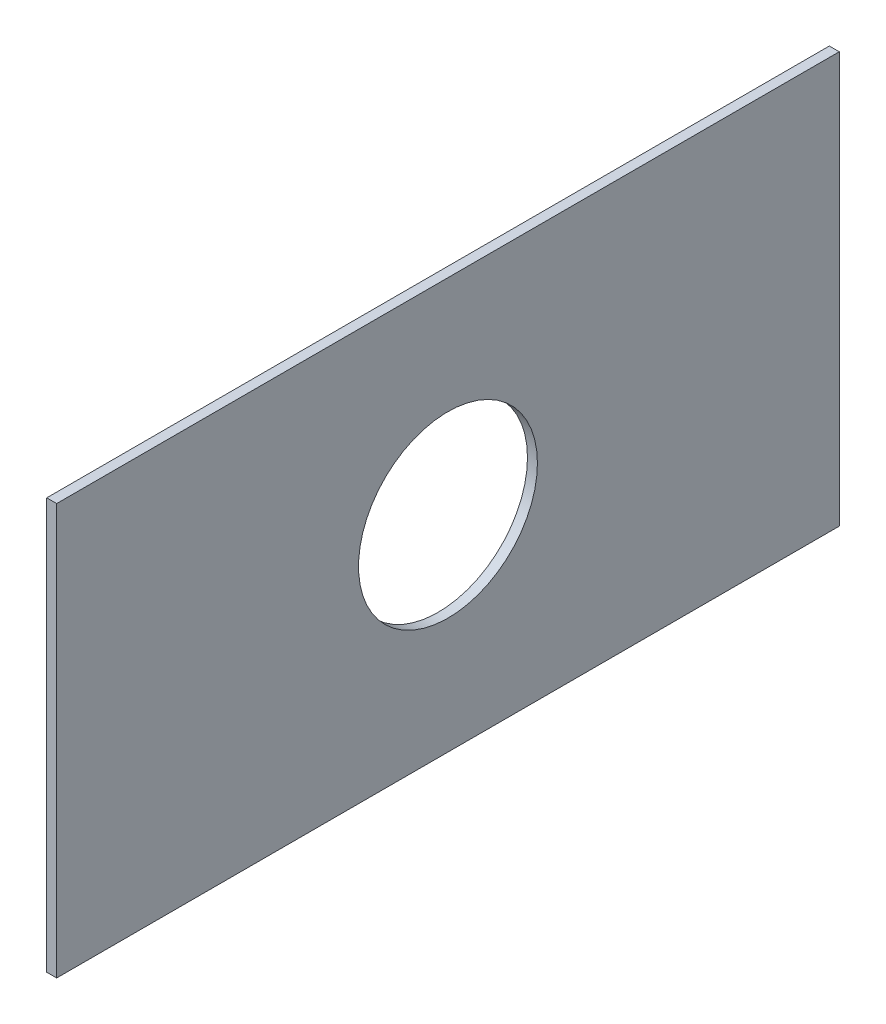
from build123d import *

# Parameters (mm, degrees)
SKETCH1_W          = 999.998
SKETCH1_H          = 525.018
EXTRUDE1_DEPTH     = 12.7
SKETCH2_R          = 114.3
CUT_EXTRUDE1_DEPTH = 1130.513696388


with BuildPart() as part:
    # Sketch1 → Extrude1 (new body)
    with BuildSketch(Plane(origin=(0, 0, 0), x_dir=(0, 0, -1), z_dir=(1, 0, 0))):
        with Locations((499.999, 262.509)):
            Rectangle(SKETCH1_W, SKETCH1_H)
    extrude(amount=EXTRUDE1_DEPTH)

    # Sketch2 → Cut-Extrude1 (cut, through all)
    with BuildSketch(Plane(origin=(12.7, 0, 0), x_dir=(0, 0, -1), z_dir=(1, 0, 0))):
        with Locations((499.999, 262.509)):
            Circle(SKETCH2_R)
    extrude(amount=-CUT_EXTRUDE1_DEPTH, mode=Mode.SUBTRACT)


solid = part.part
